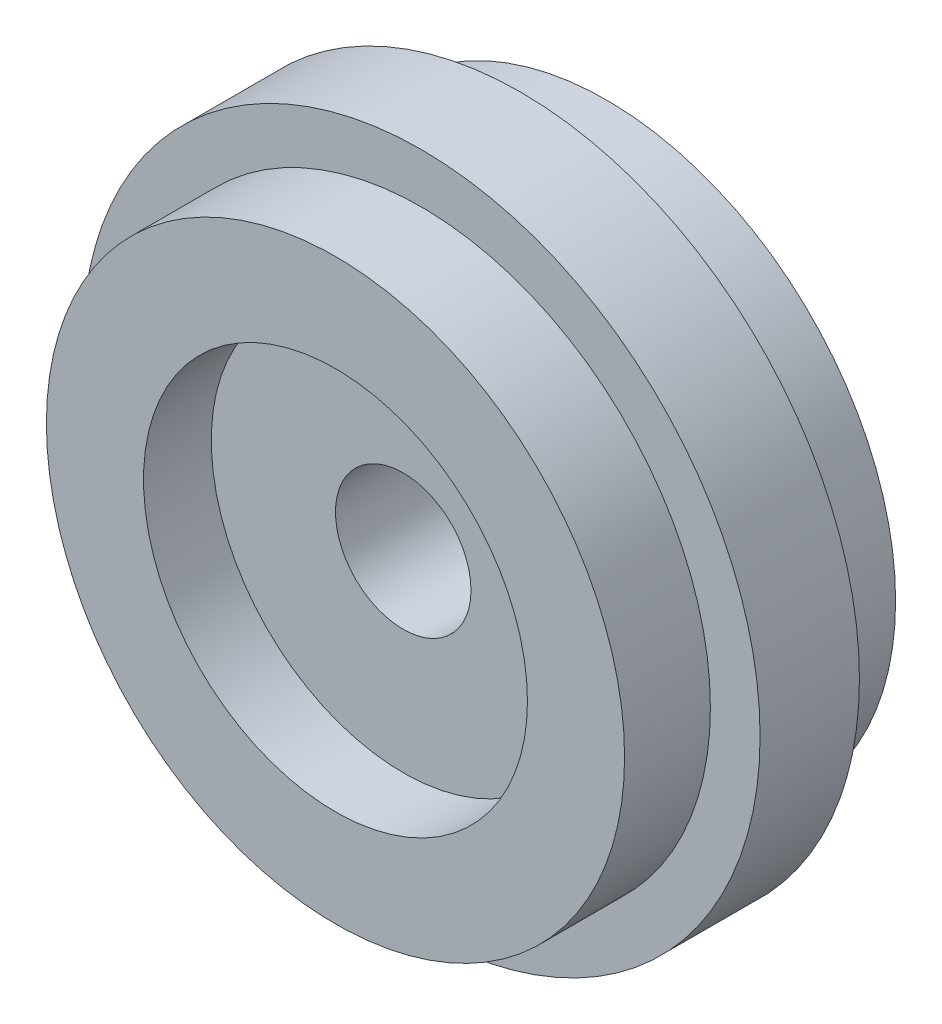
ISO-10303-21;
HEADER;
FILE_DESCRIPTION(('STEP AP214'),'2;1');
FILE_NAME('part.step','',(''),(''),'','','');
FILE_SCHEMA(('AUTOMOTIVE_DESIGN { 1 0 10303 214 1 1 1 1 }'));
ENDSEC;
DATA;
#1=APPLICATION_CONTEXT('core data for automotive mechanical design processes');
#2=APPLICATION_PROTOCOL_DEFINITION('international standard','automotive_design',2000,#1);
#3=PRODUCT_CONTEXT('',#1,'mechanical');
#4=PRODUCT('Part','Part','',(#3));
#5=PRODUCT_RELATED_PRODUCT_CATEGORY('part','',(#4));
#6=PRODUCT_DEFINITION_FORMATION('','',#4);
#7=PRODUCT_DEFINITION_CONTEXT('part definition',#1,'design');
#8=PRODUCT_DEFINITION('design','',#6,#7);
#9=PRODUCT_DEFINITION_SHAPE('','',#8);
#10=(LENGTH_UNIT() NAMED_UNIT(*) SI_UNIT(.MILLI.,.METRE.));
#11=(NAMED_UNIT(*) PLANE_ANGLE_UNIT() SI_UNIT($,.RADIAN.));
#12=(NAMED_UNIT(*) SI_UNIT($,.STERADIAN.) SOLID_ANGLE_UNIT());
#13=UNCERTAINTY_MEASURE_WITH_UNIT(LENGTH_MEASURE(1.E-05),#10,'distance_accuracy_value','');
#14=(GEOMETRIC_REPRESENTATION_CONTEXT(3) GLOBAL_UNCERTAINTY_ASSIGNED_CONTEXT((#13)) GLOBAL_UNIT_ASSIGNED_CONTEXT((#10,
#11,#12)) REPRESENTATION_CONTEXT('',''));
#15=CARTESIAN_POINT('',(0.,0.,0.));
#16=DIRECTION('',(0.,0.,1.));
#17=DIRECTION('',(1.,0.,0.));
#18=AXIS2_PLACEMENT_3D('',#15,#16,#17);
#19=CARTESIAN_POINT('',(0.,6.5,-6.));
#20=DIRECTION('',(0.,0.,1.));
#21=DIRECTION('',(1.,0.,0.));
#22=AXIS2_PLACEMENT_3D('',#19,#20,#21);
#23=PLANE('',#22);
#24=CARTESIAN_POINT('',(0.,0.,-6.));
#25=DIRECTION('',(0.,0.,1.));
#26=DIRECTION('',(1.,0.,0.));
#27=AXIS2_PLACEMENT_3D('',#24,#25,#26);
#28=CIRCLE('',#27,6.5);
#29=CARTESIAN_POINT('',(6.5,0.,-6.));
#30=VERTEX_POINT('',#29);
#31=EDGE_CURVE('E8',#30,#30,#28,.T.);
#32=ORIENTED_EDGE('',*,*,#31,.T.);
#33=EDGE_LOOP('',(#32));
#34=FACE_BOUND('',#33,.T.);
#35=CARTESIAN_POINT('',(0.,0.,-6.));
#36=DIRECTION('',(0.,0.,1.));
#37=DIRECTION('',(1.,0.,0.));
#38=AXIS2_PLACEMENT_3D('',#35,#36,#37);
#39=CIRCLE('',#38,12.8);
#40=CARTESIAN_POINT('',(12.8,0.,-6.));
#41=VERTEX_POINT('',#40);
#42=EDGE_CURVE('E15',#41,#41,#39,.T.);
#43=ORIENTED_EDGE('',*,*,#42,.F.);
#44=EDGE_LOOP('',(#43));
#45=FACE_BOUND('',#44,.T.);
#46=ADVANCED_FACE('F12',(#34,#45),#23,.F.);
#47=CARTESIAN_POINT('',(0.,15.,6.));
#48=DIRECTION('',(0.,0.,-1.));
#49=DIRECTION('',(-1.,0.,0.));
#50=AXIS2_PLACEMENT_3D('',#47,#48,#49);
#51=PLANE('',#50);
#52=CARTESIAN_POINT('',(0.,0.,6.));
#53=DIRECTION('',(0.,0.,1.));
#54=DIRECTION('',(1.,0.,0.));
#55=AXIS2_PLACEMENT_3D('',#52,#53,#54);
#56=CIRCLE('',#55,8.5);
#57=CARTESIAN_POINT('',(8.5,0.,6.));
#58=VERTEX_POINT('',#57);
#59=EDGE_CURVE('E33',#58,#58,#56,.T.);
#60=ORIENTED_EDGE('',*,*,#59,.F.);
#61=EDGE_LOOP('',(#60));
#62=FACE_BOUND('',#61,.T.);
#63=CARTESIAN_POINT('',(0.,0.,6.));
#64=DIRECTION('',(0.,0.,-1.));
#65=DIRECTION('',(-1.,0.,0.));
#66=AXIS2_PLACEMENT_3D('',#63,#64,#65);
#67=CIRCLE('',#66,12.8);
#68=CARTESIAN_POINT('',(-12.8,0.,6.));
#69=VERTEX_POINT('',#68);
#70=EDGE_CURVE('E27',#69,#69,#67,.T.);
#71=ORIENTED_EDGE('',*,*,#70,.F.);
#72=EDGE_LOOP('',(#71));
#73=FACE_BOUND('',#72,.T.);
#74=ADVANCED_FACE('F75',(#62,#73),#51,.F.);
#75=CARTESIAN_POINT('',(0.,0.,8.4819902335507));
#76=DIRECTION('',(0.,0.,1.));
#77=DIRECTION('',(1.,0.,0.));
#78=AXIS2_PLACEMENT_3D('',#75,#76,#77);
#79=CYLINDRICAL_SURFACE('',#78,6.5);
#80=ORIENTED_EDGE('',*,*,#31,.F.);
#81=EDGE_LOOP('',(#80));
#82=FACE_BOUND('',#81,.T.);
#83=CARTESIAN_POINT('',(0.,0.,-3.));
#84=DIRECTION('',(0.,0.,1.));
#85=DIRECTION('',(1.,0.,0.));
#86=AXIS2_PLACEMENT_3D('',#83,#84,#85);
#87=CIRCLE('',#86,6.5);
#88=CARTESIAN_POINT('',(6.5,0.,-3.));
#89=VERTEX_POINT('',#88);
#90=EDGE_CURVE('E19',#89,#89,#87,.T.);
#91=ORIENTED_EDGE('',*,*,#90,.T.);
#92=EDGE_LOOP('',(#91));
#93=FACE_BOUND('',#92,.T.);
#94=ADVANCED_FACE('F78',(#82,#93),#79,.F.);
#95=CARTESIAN_POINT('',(0.,3.,-3.));
#96=DIRECTION('',(0.,0.,1.));
#97=DIRECTION('',(1.,0.,0.));
#98=AXIS2_PLACEMENT_3D('',#95,#96,#97);
#99=PLANE('',#98);
#100=ORIENTED_EDGE('',*,*,#90,.F.);
#101=EDGE_LOOP('',(#100));
#102=FACE_BOUND('',#101,.T.);
#103=CARTESIAN_POINT('',(0.,0.,-3.));
#104=DIRECTION('',(0.,0.,1.));
#105=DIRECTION('',(1.,0.,0.));
#106=AXIS2_PLACEMENT_3D('',#103,#104,#105);
#107=CIRCLE('',#106,3.);
#108=CARTESIAN_POINT('',(3.,0.,-3.));
#109=VERTEX_POINT('',#108);
#110=EDGE_CURVE('E24',#109,#109,#107,.T.);
#111=ORIENTED_EDGE('',*,*,#110,.T.);
#112=EDGE_LOOP('',(#111));
#113=FACE_BOUND('',#112,.T.);
#114=ADVANCED_FACE('F54',(#102,#113),#99,.F.);
#115=CARTESIAN_POINT('',(0.,0.,8.4819902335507));
#116=DIRECTION('',(0.,0.,1.));
#117=DIRECTION('',(1.,0.,0.));
#118=AXIS2_PLACEMENT_3D('',#115,#116,#117);
#119=CYLINDRICAL_SURFACE('',#118,3.);
#120=ORIENTED_EDGE('',*,*,#110,.F.);
#121=EDGE_LOOP('',(#120));
#122=FACE_BOUND('',#121,.T.);
#123=CARTESIAN_POINT('',(0.,0.,3.));
#124=DIRECTION('',(0.,0.,1.));
#125=DIRECTION('',(1.,0.,0.));
#126=AXIS2_PLACEMENT_3D('',#123,#124,#125);
#127=CIRCLE('',#126,3.);
#128=CARTESIAN_POINT('',(3.,0.,3.));
#129=VERTEX_POINT('',#128);
#130=EDGE_CURVE('E49',#129,#129,#127,.T.);
#131=ORIENTED_EDGE('',*,*,#130,.T.);
#132=EDGE_LOOP('',(#131));
#133=FACE_BOUND('',#132,.T.);
#134=ADVANCED_FACE('F56',(#122,#133),#119,.F.);
#135=CARTESIAN_POINT('',(0.,8.5,3.));
#136=DIRECTION('',(0.,0.,-1.));
#137=DIRECTION('',(-1.,0.,0.));
#138=AXIS2_PLACEMENT_3D('',#135,#136,#137);
#139=PLANE('',#138);
#140=ORIENTED_EDGE('',*,*,#130,.F.);
#141=EDGE_LOOP('',(#140));
#142=FACE_BOUND('',#141,.T.);
#143=CARTESIAN_POINT('',(0.,0.,3.));
#144=DIRECTION('',(0.,0.,1.));
#145=DIRECTION('',(1.,0.,0.));
#146=AXIS2_PLACEMENT_3D('',#143,#144,#145);
#147=CIRCLE('',#146,8.5);
#148=CARTESIAN_POINT('',(8.5,0.,3.));
#149=VERTEX_POINT('',#148);
#150=EDGE_CURVE('E46',#149,#149,#147,.T.);
#151=ORIENTED_EDGE('',*,*,#150,.T.);
#152=EDGE_LOOP('',(#151));
#153=FACE_BOUND('',#152,.T.);
#154=ADVANCED_FACE('F59',(#142,#153),#139,.F.);
#155=CARTESIAN_POINT('',(0.,0.,8.4819902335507));
#156=DIRECTION('',(0.,0.,1.));
#157=DIRECTION('',(1.,0.,0.));
#158=AXIS2_PLACEMENT_3D('',#155,#156,#157);
#159=CYLINDRICAL_SURFACE('',#158,8.5);
#160=ORIENTED_EDGE('',*,*,#150,.F.);
#161=EDGE_LOOP('',(#160));
#162=FACE_BOUND('',#161,.T.);
#163=ORIENTED_EDGE('',*,*,#59,.T.);
#164=EDGE_LOOP('',(#163));
#165=FACE_BOUND('',#164,.T.);
#166=ADVANCED_FACE('F65',(#162,#165),#159,.F.);
#167=CARTESIAN_POINT('',(0.,0.,13.246360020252));
#168=DIRECTION('',(0.,0.,1.));
#169=DIRECTION('',(1.,0.,0.));
#170=AXIS2_PLACEMENT_3D('',#167,#168,#169);
#171=CYLINDRICAL_SURFACE('',#170,12.8);
#172=CARTESIAN_POINT('',(0.,0.,-2.2));
#173=DIRECTION('',(0.,0.,1.));
#174=DIRECTION('',(1.,0.,0.));
#175=AXIS2_PLACEMENT_3D('',#172,#173,#174);
#176=CIRCLE('',#175,12.8);
#177=CARTESIAN_POINT('',(12.8,0.,-2.2));
#178=VERTEX_POINT('',#177);
#179=EDGE_CURVE('E35',#178,#178,#176,.T.);
#180=ORIENTED_EDGE('',*,*,#179,.F.);
#181=EDGE_LOOP('',(#180));
#182=FACE_BOUND('',#181,.T.);
#183=ORIENTED_EDGE('',*,*,#42,.T.);
#184=EDGE_LOOP('',(#183));
#185=FACE_BOUND('',#184,.T.);
#186=ADVANCED_FACE('F71',(#182,#185),#171,.T.);
#187=CARTESIAN_POINT('',(0.,0.,13.246360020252));
#188=DIRECTION('',(0.,0.,1.));
#189=DIRECTION('',(1.,0.,0.));
#190=AXIS2_PLACEMENT_3D('',#187,#188,#189);
#191=CYLINDRICAL_SURFACE('',#190,12.8);
#192=CARTESIAN_POINT('',(0.,0.,2.2));
#193=DIRECTION('',(0.,0.,1.));
#194=DIRECTION('',(1.,0.,0.));
#195=AXIS2_PLACEMENT_3D('',#192,#193,#194);
#196=CIRCLE('',#195,12.8);
#197=CARTESIAN_POINT('',(12.8,0.,2.2));
#198=VERTEX_POINT('',#197);
#199=EDGE_CURVE('E29',#198,#198,#196,.T.);
#200=ORIENTED_EDGE('',*,*,#199,.T.);
#201=EDGE_LOOP('',(#200));
#202=FACE_BOUND('',#201,.T.);
#203=ORIENTED_EDGE('',*,*,#70,.T.);
#204=EDGE_LOOP('',(#203));
#205=FACE_BOUND('',#204,.T.);
#206=ADVANCED_FACE('F127',(#202,#205),#191,.T.);
#207=CARTESIAN_POINT('',(0.,12.8,2.2));
#208=DIRECTION('',(0.,0.,1.));
#209=DIRECTION('',(1.,0.,0.));
#210=AXIS2_PLACEMENT_3D('',#207,#208,#209);
#211=PLANE('',#210);
#212=CARTESIAN_POINT('',(0.,0.,2.2));
#213=DIRECTION('',(0.,0.,1.));
#214=DIRECTION('',(1.,0.,0.));
#215=AXIS2_PLACEMENT_3D('',#212,#213,#214);
#216=CIRCLE('',#215,15.);
#217=CARTESIAN_POINT('',(15.,0.,2.2));
#218=VERTEX_POINT('',#217);
#219=EDGE_CURVE('E191',#218,#218,#216,.T.);
#220=ORIENTED_EDGE('',*,*,#219,.T.);
#221=EDGE_LOOP('',(#220));
#222=FACE_BOUND('',#221,.T.);
#223=ORIENTED_EDGE('',*,*,#199,.F.);
#224=EDGE_LOOP('',(#223));
#225=FACE_BOUND('',#224,.T.);
#226=ADVANCED_FACE('F88',(#222,#225),#211,.T.);
#227=CARTESIAN_POINT('',(0.,15.,-2.2));
#228=DIRECTION('',(0.,0.,-1.));
#229=DIRECTION('',(-1.,0.,0.));
#230=AXIS2_PLACEMENT_3D('',#227,#228,#229);
#231=PLANE('',#230);
#232=ORIENTED_EDGE('',*,*,#179,.T.);
#233=EDGE_LOOP('',(#232));
#234=FACE_BOUND('',#233,.T.);
#235=CARTESIAN_POINT('',(0.,0.,-2.2));
#236=DIRECTION('',(0.,0.,1.));
#237=DIRECTION('',(1.,0.,0.));
#238=AXIS2_PLACEMENT_3D('',#235,#236,#237);
#239=CIRCLE('',#238,15.);
#240=CARTESIAN_POINT('',(15.,0.,-2.2));
#241=VERTEX_POINT('',#240);
#242=EDGE_CURVE('E40',#241,#241,#239,.T.);
#243=ORIENTED_EDGE('',*,*,#242,.F.);
#244=EDGE_LOOP('',(#243));
#245=FACE_BOUND('',#244,.T.);
#246=ADVANCED_FACE('F142',(#234,#245),#231,.T.);
#247=CARTESIAN_POINT('',(0.,0.,13.246360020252));
#248=DIRECTION('',(0.,0.,1.));
#249=DIRECTION('',(1.,0.,0.));
#250=AXIS2_PLACEMENT_3D('',#247,#248,#249);
#251=CYLINDRICAL_SURFACE('',#250,15.);
#252=ORIENTED_EDGE('',*,*,#242,.T.);
#253=EDGE_LOOP('',(#252));
#254=FACE_BOUND('',#253,.T.);
#255=ORIENTED_EDGE('',*,*,#219,.F.);
#256=EDGE_LOOP('',(#255));
#257=FACE_BOUND('',#256,.T.);
#258=ADVANCED_FACE('F150',(#254,#257),#251,.T.);
#259=CLOSED_SHELL('',(#46,#74,#94,#114,#134,#154,#166,#186,#206,#226,#246,#258));
#260=MANIFOLD_SOLID_BREP('B1',#259);
#261=ADVANCED_BREP_SHAPE_REPRESENTATION('',(#18,#260),#14);
#262=SHAPE_DEFINITION_REPRESENTATION(#9,#261);
ENDSEC;
END-ISO-10303-21;
